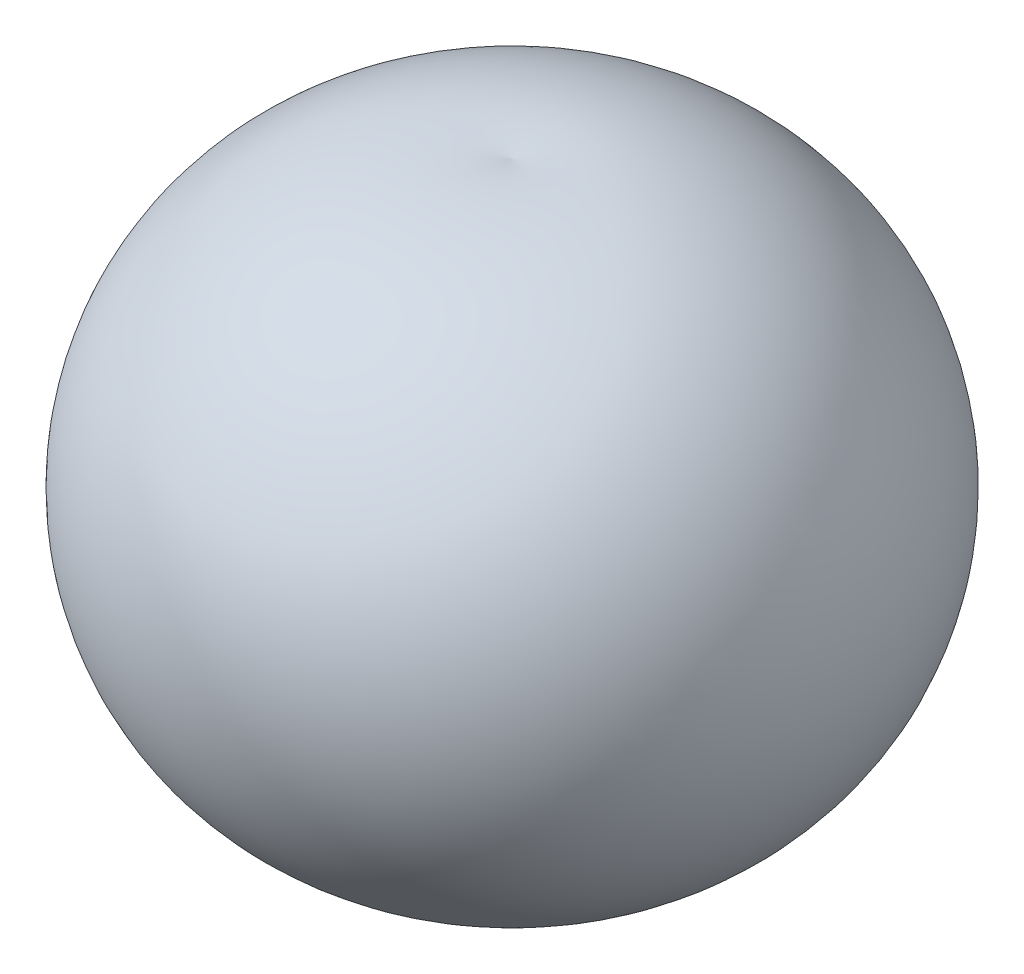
ISO-10303-21;
HEADER;
FILE_DESCRIPTION(('STEP AP214'),'2;1');
FILE_NAME('part.step','',(''),(''),'','','');
FILE_SCHEMA(('AUTOMOTIVE_DESIGN { 1 0 10303 214 1 1 1 1 }'));
ENDSEC;
DATA;
#1=APPLICATION_CONTEXT('core data for automotive mechanical design processes');
#2=APPLICATION_PROTOCOL_DEFINITION('international standard','automotive_design',2000,#1);
#3=PRODUCT_CONTEXT('',#1,'mechanical');
#4=PRODUCT('Part','Part','',(#3));
#5=PRODUCT_RELATED_PRODUCT_CATEGORY('part','',(#4));
#6=PRODUCT_DEFINITION_FORMATION('','',#4);
#7=PRODUCT_DEFINITION_CONTEXT('part definition',#1,'design');
#8=PRODUCT_DEFINITION('design','',#6,#7);
#9=PRODUCT_DEFINITION_SHAPE('','',#8);
#10=(LENGTH_UNIT() NAMED_UNIT(*) SI_UNIT(.MILLI.,.METRE.));
#11=(NAMED_UNIT(*) PLANE_ANGLE_UNIT() SI_UNIT($,.RADIAN.));
#12=(NAMED_UNIT(*) SI_UNIT($,.STERADIAN.) SOLID_ANGLE_UNIT());
#13=UNCERTAINTY_MEASURE_WITH_UNIT(LENGTH_MEASURE(1.E-05),#10,'distance_accuracy_value','');
#14=(GEOMETRIC_REPRESENTATION_CONTEXT(3) GLOBAL_UNCERTAINTY_ASSIGNED_CONTEXT((#13)) GLOBAL_UNIT_ASSIGNED_CONTEXT((#10,
#11,#12)) REPRESENTATION_CONTEXT('',''));
#15=CARTESIAN_POINT('',(0.,0.,0.));
#16=DIRECTION('',(0.,0.,1.));
#17=DIRECTION('',(1.,0.,0.));
#18=AXIS2_PLACEMENT_3D('',#15,#16,#17);
#19=CARTESIAN_POINT('',(0.,-216.604684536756,-525.511331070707));
#20=DIRECTION('',(-1.,0.,0.));
#21=DIRECTION('',(0.,0.,-1.));
#22=AXIS2_PLACEMENT_3D('',#19,#20,#21);
#23=CIRCLE('',#22,755.);
#24=TRIMMED_CURVE('',#23,(PARAMETER_VALUE(-2.34066576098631)),
(PARAMETER_VALUE(2.34066576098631)),.T.,.PARAMETER.);
#25=CARTESIAN_POINT('',(0.,-216.604684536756,0.));
#26=DIRECTION('',(0.,-1.,0.));
#27=AXIS1_PLACEMENT('',#25,#26);
#28=SURFACE_OF_REVOLUTION('',#24,#27);
#29=CARTESIAN_POINT('',(0.,-900.867063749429,0.));
#30=DIRECTION('',(0.,-1.,0.));
#31=DIRECTION('',(0.,0.,-1.));
#32=AXIS2_PLACEMENT_3D('',#29,#30,#31);
#33=CIRCLE('',#32,844.588118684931);
#34=CARTESIAN_POINT('',(0.,-900.867063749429,-844.588118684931));
#35=VERTEX_POINT('',#34);
#36=EDGE_CURVE('E25',#35,#35,#33,.T.);
#37=ORIENTED_EDGE('',*,*,#36,.T.);
#38=EDGE_LOOP('',(#37));
#39=FACE_BOUND('',#38,.T.);
#40=CARTESIAN_POINT('',(0.,-758.695858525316,0.));
#41=VERTEX_POINT('',#40);
#42=VERTEX_LOOP('',#41);
#43=FACE_BOUND('',#42,.T.);
#44=ADVANCED_FACE('F16',(#39,#43),#28,.T.);
#45=CARTESIAN_POINT('',(0.,445.,-217.));
#46=DIRECTION('',(-1.,0.,0.));
#47=DIRECTION('',(0.,0.,-1.));
#48=AXIS2_PLACEMENT_3D('',#45,#46,#47);
#49=CIRCLE('',#48,1485.);
#50=TRIMMED_CURVE('',#49,(PARAMETER_VALUE(-1.71744938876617)),
(PARAMETER_VALUE(1.71744938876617)),.T.,.PARAMETER.);
#51=CARTESIAN_POINT('',(0.,445.,0.));
#52=DIRECTION('',(0.,-1.,0.));
#53=AXIS1_PLACEMENT('',#51,#52);
#54=SURFACE_OF_REVOLUTION('',#50,#53);
#55=CARTESIAN_POINT('',(0.,1914.05956312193,0.));
#56=VERTEX_POINT('',#55);
#57=VERTEX_LOOP('',#56);
#58=FACE_BOUND('',#57,.T.);
#59=ORIENTED_EDGE('',*,*,#36,.F.);
#60=EDGE_LOOP('',(#59));
#61=FACE_BOUND('',#60,.T.);
#62=ADVANCED_FACE('F51',(#58,#61),#54,.T.);
#63=CLOSED_SHELL('',(#44,#62));
#64=CARTESIAN_POINT('',(0.,381.376307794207,510.222129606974));
#65=DIRECTION('',(-1.,0.,0.));
#66=DIRECTION('',(0.,0.,-1.));
#67=AXIS2_PLACEMENT_3D('',#64,#65,#66);
#68=CIRCLE('',#67,755.);
#69=TRIMMED_CURVE('',#68,(PARAMETER_VALUE(-0.828759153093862)),
(PARAMETER_VALUE(0.828759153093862)),.T.,.PARAMETER.);
#70=CARTESIAN_POINT('',(0.,381.376307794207,0.));
#71=DIRECTION('',(0.,-1.,0.));
#72=AXIS1_PLACEMENT('',#70,#71);
#73=SURFACE_OF_REVOLUTION('',#69,#72);
#74=CARTESIAN_POINT('',(0.,937.881814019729,0.));
#75=VERTEX_POINT('',#74);
#76=VERTEX_LOOP('',#75);
#77=FACE_BOUND('',#76,.T.);
#78=CARTESIAN_POINT('',(0.,718.185878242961,0.));
#79=DIRECTION('',(0.,-1.,0.));
#80=DIRECTION('',(0.,0.,-1.));
#81=AXIS2_PLACEMENT_3D('',#78,#79,#80);
#82=CIRCLE('',#81,165.488099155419);
#83=CARTESIAN_POINT('',(0.,718.185878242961,-165.488099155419));
#84=VERTEX_POINT('',#83);
#85=EDGE_CURVE('E9',#84,#84,#82,.T.);
#86=ORIENTED_EDGE('',*,*,#85,.T.);
#87=EDGE_LOOP('',(#86));
#88=FACE_BOUND('',#87,.T.);
#89=ADVANCED_FACE('F18',(#77,#88),#73,.F.);
#90=CARTESIAN_POINT('',(0.,445.,-217.));
#91=DIRECTION('',(-1.,0.,0.));
#92=DIRECTION('',(0.,0.,-1.));
#93=AXIS2_PLACEMENT_3D('',#90,#91,#92);
#94=CIRCLE('',#93,278.);
#95=TRIMMED_CURVE('',#94,(PARAMETER_VALUE(-2.46638238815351)),
(PARAMETER_VALUE(2.46638238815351)),.T.,.PARAMETER.);
#96=CARTESIAN_POINT('',(0.,445.,0.));
#97=DIRECTION('',(0.,-1.,0.));
#98=AXIS1_PLACEMENT('',#96,#97);
#99=SURFACE_OF_REVOLUTION('',#95,#98);
#100=ORIENTED_EDGE('',*,*,#85,.F.);
#101=EDGE_LOOP('',(#100));
#102=FACE_BOUND('',#101,.T.);
#103=CARTESIAN_POINT('',(0.,271.232914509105,0.));
#104=VERTEX_POINT('',#103);
#105=VERTEX_LOOP('',#104);
#106=FACE_BOUND('',#105,.T.);
#107=ADVANCED_FACE('F38',(#102,#106),#99,.F.);
#108=CLOSED_SHELL('',(#89,#107));
#109=ORIENTED_CLOSED_SHELL('',*,#108,.T.);
#110=BREP_WITH_VOIDS('B1',#63,(#109));
#111=ADVANCED_BREP_SHAPE_REPRESENTATION('',(#18,#110),#14);
#112=SHAPE_DEFINITION_REPRESENTATION(#9,#111);
ENDSEC;
END-ISO-10303-21;
